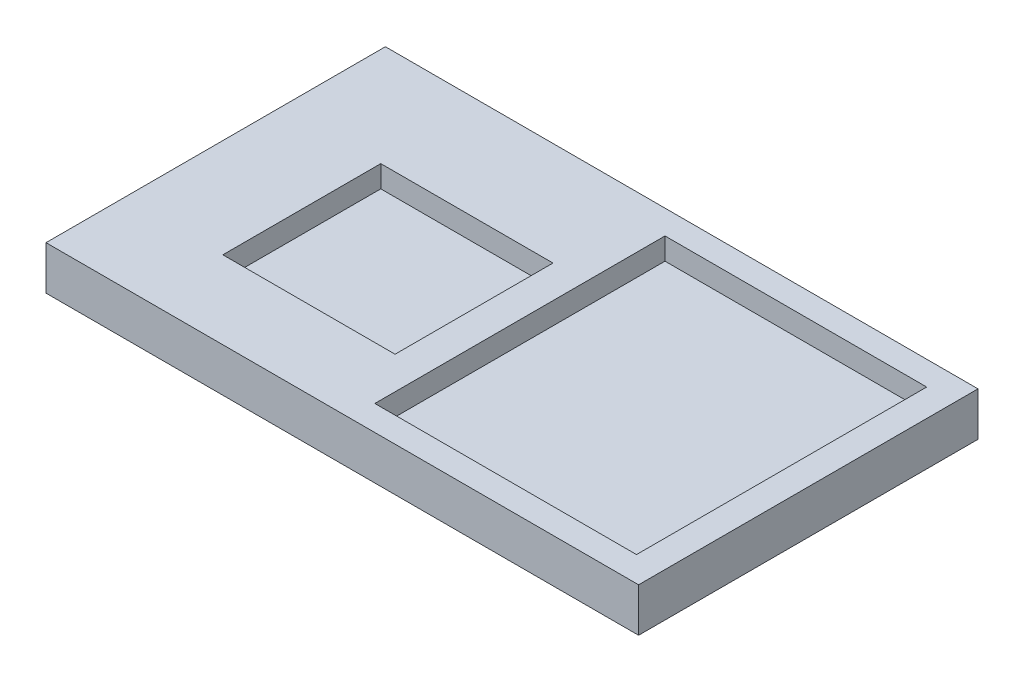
ISO-10303-21;
HEADER;
FILE_DESCRIPTION(('STEP AP214'),'2;1');
FILE_NAME('part.step','',(''),(''),'','','');
FILE_SCHEMA(('AUTOMOTIVE_DESIGN { 1 0 10303 214 1 1 1 1 }'));
ENDSEC;
DATA;
#1=APPLICATION_CONTEXT('core data for automotive mechanical design processes');
#2=APPLICATION_PROTOCOL_DEFINITION('international standard','automotive_design',2000,#1);
#3=PRODUCT_CONTEXT('',#1,'mechanical');
#4=PRODUCT('Part','Part','',(#3));
#5=PRODUCT_RELATED_PRODUCT_CATEGORY('part','',(#4));
#6=PRODUCT_DEFINITION_FORMATION('','',#4);
#7=PRODUCT_DEFINITION_CONTEXT('part definition',#1,'design');
#8=PRODUCT_DEFINITION('design','',#6,#7);
#9=PRODUCT_DEFINITION_SHAPE('','',#8);
#10=(LENGTH_UNIT() NAMED_UNIT(*) SI_UNIT(.MILLI.,.METRE.));
#11=(NAMED_UNIT(*) PLANE_ANGLE_UNIT() SI_UNIT($,.RADIAN.));
#12=(NAMED_UNIT(*) SI_UNIT($,.STERADIAN.) SOLID_ANGLE_UNIT());
#13=UNCERTAINTY_MEASURE_WITH_UNIT(LENGTH_MEASURE(1.E-05),#10,'distance_accuracy_value','');
#14=(GEOMETRIC_REPRESENTATION_CONTEXT(3) GLOBAL_UNCERTAINTY_ASSIGNED_CONTEXT((#13)) GLOBAL_UNIT_ASSIGNED_CONTEXT((#10,
#11,#12)) REPRESENTATION_CONTEXT('',''));
#15=CARTESIAN_POINT('',(0.,0.,0.));
#16=DIRECTION('',(0.,0.,1.));
#17=DIRECTION('',(1.,0.,0.));
#18=AXIS2_PLACEMENT_3D('',#15,#16,#17);
#19=CARTESIAN_POINT('',(-72.2568376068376,12.7,-49.1219729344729));
#20=DIRECTION('',(1.,0.,0.));
#21=DIRECTION('',(0.,0.,-1.));
#22=AXIS2_PLACEMENT_3D('',#19,#20,#21);
#23=PLANE('',#22);
#24=DIRECTION('',(0.,0.,1.));
#25=VECTOR('',#24,1.);
#26=CARTESIAN_POINT('',(-72.2568376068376,0.,-49.1219729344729));
#27=LINE('',#26,#25);
#28=CARTESIAN_POINT('',(-72.2568376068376,0.,-49.1219729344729));
#29=VERTEX_POINT('',#28);
#30=CARTESIAN_POINT('',(-72.2568376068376,0.,49.4388888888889));
#31=VERTEX_POINT('',#30);
#32=EDGE_CURVE('E191',#29,#31,#27,.T.);
#33=ORIENTED_EDGE('',*,*,#32,.T.);
#34=DIRECTION('',(0.,-1.,0.));
#35=VECTOR('',#34,1.);
#36=CARTESIAN_POINT('',(-72.2568376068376,12.7,49.4388888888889));
#37=LINE('',#36,#35);
#38=CARTESIAN_POINT('',(-72.2568376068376,12.7,49.4388888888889));
#39=VERTEX_POINT('',#38);
#40=EDGE_CURVE('E11',#39,#31,#37,.T.);
#41=ORIENTED_EDGE('',*,*,#40,.F.);
#42=DIRECTION('',(0.,0.,1.));
#43=VECTOR('',#42,1.);
#44=CARTESIAN_POINT('',(-72.2568376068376,12.7,-49.1219729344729));
#45=LINE('',#44,#43);
#46=CARTESIAN_POINT('',(-72.2568376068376,12.7,-49.1219729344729));
#47=VERTEX_POINT('',#46);
#48=EDGE_CURVE('E205',#47,#39,#45,.T.);
#49=ORIENTED_EDGE('',*,*,#48,.F.);
#50=DIRECTION('',(0.,-1.,0.));
#51=VECTOR('',#50,1.);
#52=CARTESIAN_POINT('',(-72.2568376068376,12.7,-49.1219729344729));
#53=LINE('',#52,#51);
#54=EDGE_CURVE('E214',#47,#29,#53,.T.);
#55=ORIENTED_EDGE('',*,*,#54,.T.);
#56=EDGE_LOOP('',(#33,#41,#49,#55));
#57=FACE_BOUND('',#56,.T.);
#58=ADVANCED_FACE('F38',(#57),#23,.F.);
#59=CARTESIAN_POINT('',(-72.2568376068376,12.7,49.4388888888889));
#60=DIRECTION('',(0.,0.,-1.));
#61=DIRECTION('',(-1.,0.,0.));
#62=AXIS2_PLACEMENT_3D('',#59,#60,#61);
#63=PLANE('',#62);
#64=DIRECTION('',(1.,0.,0.));
#65=VECTOR('',#64,1.);
#66=CARTESIAN_POINT('',(-72.2568376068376,0.,49.4388888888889));
#67=LINE('',#66,#65);
#68=CARTESIAN_POINT('',(99.8285256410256,0.,49.4388888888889));
#69=VERTEX_POINT('',#68);
#70=EDGE_CURVE('E199',#31,#69,#67,.T.);
#71=ORIENTED_EDGE('',*,*,#70,.T.);
#72=DIRECTION('',(0.,-1.,0.));
#73=VECTOR('',#72,1.);
#74=CARTESIAN_POINT('',(99.8285256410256,12.7,49.4388888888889));
#75=LINE('',#74,#73);
#76=CARTESIAN_POINT('',(99.8285256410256,12.7,49.4388888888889));
#77=VERTEX_POINT('',#76);
#78=EDGE_CURVE('E45',#77,#69,#75,.T.);
#79=ORIENTED_EDGE('',*,*,#78,.F.);
#80=DIRECTION('',(1.,0.,0.));
#81=VECTOR('',#80,1.);
#82=CARTESIAN_POINT('',(-72.2568376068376,12.7,49.4388888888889));
#83=LINE('',#82,#81);
#84=EDGE_CURVE('E208',#39,#77,#83,.T.);
#85=ORIENTED_EDGE('',*,*,#84,.F.);
#86=ORIENTED_EDGE('',*,*,#40,.T.);
#87=EDGE_LOOP('',(#71,#79,#85,#86));
#88=FACE_BOUND('',#87,.T.);
#89=ADVANCED_FACE('F239',(#88),#63,.F.);
#90=CARTESIAN_POINT('',(99.8285256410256,12.7,-49.1219729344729));
#91=DIRECTION('',(-1.,0.,0.));
#92=DIRECTION('',(0.,0.,1.));
#93=AXIS2_PLACEMENT_3D('',#90,#91,#92);
#94=PLANE('',#93);
#95=DIRECTION('',(0.,0.,-1.));
#96=VECTOR('',#95,1.);
#97=CARTESIAN_POINT('',(99.8285256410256,0.,-49.1219729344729));
#98=LINE('',#97,#96);
#99=CARTESIAN_POINT('',(99.8285256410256,0.,-49.1219729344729));
#100=VERTEX_POINT('',#99);
#101=EDGE_CURVE('E201',#69,#100,#98,.T.);
#102=ORIENTED_EDGE('',*,*,#101,.T.);
#103=DIRECTION('',(0.,-1.,0.));
#104=VECTOR('',#103,1.);
#105=CARTESIAN_POINT('',(99.8285256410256,12.7,-49.1219729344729));
#106=LINE('',#105,#104);
#107=CARTESIAN_POINT('',(99.8285256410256,12.7,-49.1219729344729));
#108=VERTEX_POINT('',#107);
#109=EDGE_CURVE('E217',#108,#100,#106,.T.);
#110=ORIENTED_EDGE('',*,*,#109,.F.);
#111=DIRECTION('',(0.,0.,-1.));
#112=VECTOR('',#111,1.);
#113=CARTESIAN_POINT('',(99.8285256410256,12.7,-49.1219729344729));
#114=LINE('',#113,#112);
#115=EDGE_CURVE('E210',#77,#108,#114,.T.);
#116=ORIENTED_EDGE('',*,*,#115,.F.);
#117=ORIENTED_EDGE('',*,*,#78,.T.);
#118=EDGE_LOOP('',(#102,#110,#116,#117));
#119=FACE_BOUND('',#118,.T.);
#120=ADVANCED_FACE('F224',(#119),#94,.F.);
#121=CARTESIAN_POINT('',(-72.2568376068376,12.7,-49.1219729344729));
#122=DIRECTION('',(0.,0.,1.));
#123=DIRECTION('',(1.,0.,0.));
#124=AXIS2_PLACEMENT_3D('',#121,#122,#123);
#125=PLANE('',#124);
#126=DIRECTION('',(-1.,0.,0.));
#127=VECTOR('',#126,1.);
#128=CARTESIAN_POINT('',(-72.2568376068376,0.,-49.1219729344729));
#129=LINE('',#128,#127);
#130=EDGE_CURVE('E203',#100,#29,#129,.T.);
#131=ORIENTED_EDGE('',*,*,#130,.T.);
#132=ORIENTED_EDGE('',*,*,#54,.F.);
#133=DIRECTION('',(-1.,0.,0.));
#134=VECTOR('',#133,1.);
#135=CARTESIAN_POINT('',(-72.2568376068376,12.7,-49.1219729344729));
#136=LINE('',#135,#134);
#137=EDGE_CURVE('E212',#108,#47,#136,.T.);
#138=ORIENTED_EDGE('',*,*,#137,.F.);
#139=ORIENTED_EDGE('',*,*,#109,.T.);
#140=EDGE_LOOP('',(#131,#132,#138,#139));
#141=FACE_BOUND('',#140,.T.);
#142=ADVANCED_FACE('F233',(#141),#125,.F.);
#143=CARTESIAN_POINT('',(-72.2568376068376,12.7,49.4388888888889));
#144=DIRECTION('',(0.,1.,0.));
#145=DIRECTION('',(0.,0.,1.));
#146=AXIS2_PLACEMENT_3D('',#143,#144,#145);
#147=PLANE('',#146);
#148=DIRECTION('',(0.,0.,-1.));
#149=VECTOR('',#148,1.);
#150=CARTESIAN_POINT('',(91.9228946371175,12.7,-42.1274752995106));
#151=LINE('',#150,#149);
#152=CARTESIAN_POINT('',(91.9228946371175,12.7,42.1379714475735));
#153=VERTEX_POINT('',#152);
#154=CARTESIAN_POINT('',(91.9228946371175,12.7,-42.1274752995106));
#155=VERTEX_POINT('',#154);
#156=EDGE_CURVE('E52',#153,#155,#151,.T.);
#157=ORIENTED_EDGE('',*,*,#156,.F.);
#158=DIRECTION('',(1.,0.,0.));
#159=VECTOR('',#158,1.);
#160=CARTESIAN_POINT('',(91.9228946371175,12.7,42.1379714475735));
#161=LINE('',#160,#159);
#162=CARTESIAN_POINT('',(15.9307826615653,12.7,42.1379714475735));
#163=VERTEX_POINT('',#162);
#164=EDGE_CURVE('E148',#163,#153,#161,.T.);
#165=ORIENTED_EDGE('',*,*,#164,.F.);
#166=DIRECTION('',(0.,0.,1.));
#167=VECTOR('',#166,1.);
#168=CARTESIAN_POINT('',(15.9307826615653,12.7,-42.1274752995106));
#169=LINE('',#168,#167);
#170=CARTESIAN_POINT('',(15.9307826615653,12.7,-42.1274752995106));
#171=VERTEX_POINT('',#170);
#172=EDGE_CURVE('E130',#171,#163,#169,.T.);
#173=ORIENTED_EDGE('',*,*,#172,.F.);
#174=DIRECTION('',(-1.,0.,0.));
#175=VECTOR('',#174,1.);
#176=CARTESIAN_POINT('',(91.9228946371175,12.7,-42.1274752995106));
#177=LINE('',#176,#175);
#178=EDGE_CURVE('E141',#155,#171,#177,.T.);
#179=ORIENTED_EDGE('',*,*,#178,.F.);
#180=EDGE_LOOP('',(#157,#165,#173,#179));
#181=FACE_BOUND('',#180,.T.);
#182=DIRECTION('',(0.,0.,1.));
#183=VECTOR('',#182,1.);
#184=CARTESIAN_POINT('',(-43.5257767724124,12.7,-19.049033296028));
#185=LINE('',#184,#183);
#186=CARTESIAN_POINT('',(-43.5257767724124,12.7,-19.049033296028));
#187=VERTEX_POINT('',#186);
#188=CARTESIAN_POINT('',(-43.5257767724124,12.7,26.8129621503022));
#189=VERTEX_POINT('',#188);
#190=EDGE_CURVE('E60',#187,#189,#185,.T.);
#191=ORIENTED_EDGE('',*,*,#190,.F.);
#192=DIRECTION('',(-1.,0.,0.));
#193=VECTOR('',#192,1.);
#194=CARTESIAN_POINT('',(-43.5257767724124,12.7,-19.049033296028));
#195=LINE('',#194,#193);
#196=CARTESIAN_POINT('',(6.48273151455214,12.7,-19.049033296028));
#197=VERTEX_POINT('',#196);
#198=EDGE_CURVE('E173',#197,#187,#195,.T.);
#199=ORIENTED_EDGE('',*,*,#198,.F.);
#200=DIRECTION('',(0.,0.,-1.));
#201=VECTOR('',#200,1.);
#202=CARTESIAN_POINT('',(6.48273151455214,12.7,-19.049033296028));
#203=LINE('',#202,#201);
#204=CARTESIAN_POINT('',(6.48273151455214,12.7,26.8129621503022));
#205=VERTEX_POINT('',#204);
#206=EDGE_CURVE('E170',#205,#197,#203,.T.);
#207=ORIENTED_EDGE('',*,*,#206,.F.);
#208=DIRECTION('',(1.,0.,0.));
#209=VECTOR('',#208,1.);
#210=CARTESIAN_POINT('',(-43.5257767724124,12.7,26.8129621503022));
#211=LINE('',#210,#209);
#212=EDGE_CURVE('E167',#189,#205,#211,.T.);
#213=ORIENTED_EDGE('',*,*,#212,.F.);
#214=EDGE_LOOP('',(#191,#199,#207,#213));
#215=FACE_BOUND('',#214,.T.);
#216=ORIENTED_EDGE('',*,*,#48,.T.);
#217=ORIENTED_EDGE('',*,*,#84,.T.);
#218=ORIENTED_EDGE('',*,*,#115,.T.);
#219=ORIENTED_EDGE('',*,*,#137,.T.);
#220=EDGE_LOOP('',(#216,#217,#218,#219));
#221=FACE_BOUND('',#220,.T.);
#222=ADVANCED_FACE('F145',(#181,#215,#221),#147,.T.);
#223=CARTESIAN_POINT('',(-72.2568376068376,0.,49.4388888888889));
#224=DIRECTION('',(0.,1.,0.));
#225=DIRECTION('',(0.,0.,1.));
#226=AXIS2_PLACEMENT_3D('',#223,#224,#225);
#227=PLANE('',#226);
#228=ORIENTED_EDGE('',*,*,#32,.F.);
#229=ORIENTED_EDGE('',*,*,#130,.F.);
#230=ORIENTED_EDGE('',*,*,#101,.F.);
#231=ORIENTED_EDGE('',*,*,#70,.F.);
#232=EDGE_LOOP('',(#228,#229,#230,#231));
#233=FACE_BOUND('',#232,.T.);
#234=ADVANCED_FACE('F230',(#233),#227,.F.);
#235=CARTESIAN_POINT('',(-43.5257767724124,6.35,-19.049033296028));
#236=DIRECTION('',(-1.,0.,0.));
#237=DIRECTION('',(0.,0.,1.));
#238=AXIS2_PLACEMENT_3D('',#235,#236,#237);
#239=PLANE('',#238);
#240=ORIENTED_EDGE('',*,*,#190,.T.);
#241=DIRECTION('',(0.,1.,0.));
#242=VECTOR('',#241,1.);
#243=CARTESIAN_POINT('',(-43.5257767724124,6.35,26.8129621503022));
#244=LINE('',#243,#242);
#245=CARTESIAN_POINT('',(-43.5257767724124,6.35,26.8129621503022));
#246=VERTEX_POINT('',#245);
#247=EDGE_CURVE('E188',#246,#189,#244,.T.);
#248=ORIENTED_EDGE('',*,*,#247,.F.);
#249=DIRECTION('',(0.,0.,1.));
#250=VECTOR('',#249,1.);
#251=CARTESIAN_POINT('',(-43.5257767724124,6.35,-19.049033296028));
#252=LINE('',#251,#250);
#253=CARTESIAN_POINT('',(-43.5257767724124,6.35,-19.049033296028));
#254=VERTEX_POINT('',#253);
#255=EDGE_CURVE('E176',#254,#246,#252,.T.);
#256=ORIENTED_EDGE('',*,*,#255,.F.);
#257=DIRECTION('',(0.,1.,0.));
#258=VECTOR('',#257,1.);
#259=CARTESIAN_POINT('',(-43.5257767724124,6.35,-19.049033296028));
#260=LINE('',#259,#258);
#261=EDGE_CURVE('E189',#254,#187,#260,.T.);
#262=ORIENTED_EDGE('',*,*,#261,.T.);
#263=EDGE_LOOP('',(#240,#248,#256,#262));
#264=FACE_BOUND('',#263,.T.);
#265=ADVANCED_FACE('F253',(#264),#239,.F.);
#266=CARTESIAN_POINT('',(-43.5257767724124,6.35,-19.049033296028));
#267=DIRECTION('',(0.,0.,-1.));
#268=DIRECTION('',(-1.,0.,0.));
#269=AXIS2_PLACEMENT_3D('',#266,#267,#268);
#270=PLANE('',#269);
#271=ORIENTED_EDGE('',*,*,#198,.T.);
#272=ORIENTED_EDGE('',*,*,#261,.F.);
#273=DIRECTION('',(-1.,0.,0.));
#274=VECTOR('',#273,1.);
#275=CARTESIAN_POINT('',(-43.5257767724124,6.35,-19.049033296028));
#276=LINE('',#275,#274);
#277=CARTESIAN_POINT('',(6.48273151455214,6.35,-19.049033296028));
#278=VERTEX_POINT('',#277);
#279=EDGE_CURVE('E185',#278,#254,#276,.T.);
#280=ORIENTED_EDGE('',*,*,#279,.F.);
#281=DIRECTION('',(0.,1.,0.));
#282=VECTOR('',#281,1.);
#283=CARTESIAN_POINT('',(6.48273151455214,6.35,-19.049033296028));
#284=LINE('',#283,#282);
#285=EDGE_CURVE('E192',#278,#197,#284,.T.);
#286=ORIENTED_EDGE('',*,*,#285,.T.);
#287=EDGE_LOOP('',(#271,#272,#280,#286));
#288=FACE_BOUND('',#287,.T.);
#289=ADVANCED_FACE('F256',(#288),#270,.F.);
#290=CARTESIAN_POINT('',(6.48273151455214,6.35,-19.049033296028));
#291=DIRECTION('',(1.,0.,0.));
#292=DIRECTION('',(0.,0.,-1.));
#293=AXIS2_PLACEMENT_3D('',#290,#291,#292);
#294=PLANE('',#293);
#295=ORIENTED_EDGE('',*,*,#206,.T.);
#296=ORIENTED_EDGE('',*,*,#285,.F.);
#297=DIRECTION('',(0.,0.,-1.));
#298=VECTOR('',#297,1.);
#299=CARTESIAN_POINT('',(6.48273151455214,6.35,-19.049033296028));
#300=LINE('',#299,#298);
#301=CARTESIAN_POINT('',(6.48273151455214,6.35,26.8129621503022));
#302=VERTEX_POINT('',#301);
#303=EDGE_CURVE('E182',#302,#278,#300,.T.);
#304=ORIENTED_EDGE('',*,*,#303,.F.);
#305=DIRECTION('',(0.,1.,0.));
#306=VECTOR('',#305,1.);
#307=CARTESIAN_POINT('',(6.48273151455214,6.35,26.8129621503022));
#308=LINE('',#307,#306);
#309=EDGE_CURVE('E194',#302,#205,#308,.T.);
#310=ORIENTED_EDGE('',*,*,#309,.T.);
#311=EDGE_LOOP('',(#295,#296,#304,#310));
#312=FACE_BOUND('',#311,.T.);
#313=ADVANCED_FACE('F261',(#312),#294,.F.);
#314=CARTESIAN_POINT('',(-43.5257767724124,6.35,26.8129621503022));
#315=DIRECTION('',(0.,0.,1.));
#316=DIRECTION('',(1.,0.,0.));
#317=AXIS2_PLACEMENT_3D('',#314,#315,#316);
#318=PLANE('',#317);
#319=ORIENTED_EDGE('',*,*,#212,.T.);
#320=ORIENTED_EDGE('',*,*,#309,.F.);
#321=DIRECTION('',(1.,0.,0.));
#322=VECTOR('',#321,1.);
#323=CARTESIAN_POINT('',(-43.5257767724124,6.35,26.8129621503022));
#324=LINE('',#323,#322);
#325=EDGE_CURVE('E179',#246,#302,#324,.T.);
#326=ORIENTED_EDGE('',*,*,#325,.F.);
#327=ORIENTED_EDGE('',*,*,#247,.T.);
#328=EDGE_LOOP('',(#319,#320,#326,#327));
#329=FACE_BOUND('',#328,.T.);
#330=ADVANCED_FACE('F257',(#329),#318,.F.);
#331=CARTESIAN_POINT('',(-43.5257767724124,6.35,26.8129621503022));
#332=DIRECTION('',(0.,1.,0.));
#333=DIRECTION('',(0.,0.,1.));
#334=AXIS2_PLACEMENT_3D('',#331,#332,#333);
#335=PLANE('',#334);
#336=ORIENTED_EDGE('',*,*,#255,.T.);
#337=ORIENTED_EDGE('',*,*,#325,.T.);
#338=ORIENTED_EDGE('',*,*,#303,.T.);
#339=ORIENTED_EDGE('',*,*,#279,.T.);
#340=EDGE_LOOP('',(#336,#337,#338,#339));
#341=FACE_BOUND('',#340,.T.);
#342=ADVANCED_FACE('F260',(#341),#335,.T.);
#343=CARTESIAN_POINT('',(91.9228946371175,6.35,-42.1274752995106));
#344=DIRECTION('',(1.,0.,0.));
#345=DIRECTION('',(0.,0.,-1.));
#346=AXIS2_PLACEMENT_3D('',#343,#344,#345);
#347=PLANE('',#346);
#348=ORIENTED_EDGE('',*,*,#156,.T.);
#349=DIRECTION('',(0.,1.,0.));
#350=VECTOR('',#349,1.);
#351=CARTESIAN_POINT('',(91.9228946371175,6.35,-42.1274752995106));
#352=LINE('',#351,#350);
#353=CARTESIAN_POINT('',(91.9228946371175,6.35,-42.1274752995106));
#354=VERTEX_POINT('',#353);
#355=EDGE_CURVE('E138',#354,#155,#352,.T.);
#356=ORIENTED_EDGE('',*,*,#355,.F.);
#357=DIRECTION('',(0.,0.,-1.));
#358=VECTOR('',#357,1.);
#359=CARTESIAN_POINT('',(91.9228946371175,6.35,-42.1274752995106));
#360=LINE('',#359,#358);
#361=CARTESIAN_POINT('',(91.9228946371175,6.35,42.1379714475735));
#362=VERTEX_POINT('',#361);
#363=EDGE_CURVE('E150',#362,#354,#360,.T.);
#364=ORIENTED_EDGE('',*,*,#363,.F.);
#365=DIRECTION('',(0.,1.,0.));
#366=VECTOR('',#365,1.);
#367=CARTESIAN_POINT('',(91.9228946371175,6.35,42.1379714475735));
#368=LINE('',#367,#366);
#369=EDGE_CURVE('E162',#362,#153,#368,.T.);
#370=ORIENTED_EDGE('',*,*,#369,.T.);
#371=EDGE_LOOP('',(#348,#356,#364,#370));
#372=FACE_BOUND('',#371,.T.);
#373=ADVANCED_FACE('F271',(#372),#347,.F.);
#374=CARTESIAN_POINT('',(91.9228946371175,6.35,42.1379714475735));
#375=DIRECTION('',(0.,0.,1.));
#376=DIRECTION('',(1.,0.,0.));
#377=AXIS2_PLACEMENT_3D('',#374,#375,#376);
#378=PLANE('',#377);
#379=ORIENTED_EDGE('',*,*,#164,.T.);
#380=ORIENTED_EDGE('',*,*,#369,.F.);
#381=DIRECTION('',(1.,0.,0.));
#382=VECTOR('',#381,1.);
#383=CARTESIAN_POINT('',(91.9228946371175,6.35,42.1379714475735));
#384=LINE('',#383,#382);
#385=CARTESIAN_POINT('',(15.9307826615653,6.35,42.1379714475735));
#386=VERTEX_POINT('',#385);
#387=EDGE_CURVE('E159',#386,#362,#384,.T.);
#388=ORIENTED_EDGE('',*,*,#387,.F.);
#389=DIRECTION('',(0.,1.,0.));
#390=VECTOR('',#389,1.);
#391=CARTESIAN_POINT('',(15.9307826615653,6.35,42.1379714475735));
#392=LINE('',#391,#390);
#393=EDGE_CURVE('E137',#386,#163,#392,.T.);
#394=ORIENTED_EDGE('',*,*,#393,.T.);
#395=EDGE_LOOP('',(#379,#380,#388,#394));
#396=FACE_BOUND('',#395,.T.);
#397=ADVANCED_FACE('F275',(#396),#378,.F.);
#398=CARTESIAN_POINT('',(15.9307826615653,6.35,-42.1274752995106));
#399=DIRECTION('',(-1.,0.,0.));
#400=DIRECTION('',(0.,0.,1.));
#401=AXIS2_PLACEMENT_3D('',#398,#399,#400);
#402=PLANE('',#401);
#403=ORIENTED_EDGE('',*,*,#172,.T.);
#404=ORIENTED_EDGE('',*,*,#393,.F.);
#405=DIRECTION('',(0.,0.,1.));
#406=VECTOR('',#405,1.);
#407=CARTESIAN_POINT('',(15.9307826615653,6.35,-42.1274752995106));
#408=LINE('',#407,#406);
#409=CARTESIAN_POINT('',(15.9307826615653,6.35,-42.1274752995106));
#410=VERTEX_POINT('',#409);
#411=EDGE_CURVE('E133',#410,#386,#408,.T.);
#412=ORIENTED_EDGE('',*,*,#411,.F.);
#413=DIRECTION('',(0.,1.,0.));
#414=VECTOR('',#413,1.);
#415=CARTESIAN_POINT('',(15.9307826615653,6.35,-42.1274752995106));
#416=LINE('',#415,#414);
#417=EDGE_CURVE('E126',#410,#171,#416,.T.);
#418=ORIENTED_EDGE('',*,*,#417,.T.);
#419=EDGE_LOOP('',(#403,#404,#412,#418));
#420=FACE_BOUND('',#419,.T.);
#421=ADVANCED_FACE('F128',(#420),#402,.F.);
#422=CARTESIAN_POINT('',(91.9228946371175,6.35,-42.1274752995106));
#423=DIRECTION('',(0.,0.,-1.));
#424=DIRECTION('',(-1.,0.,0.));
#425=AXIS2_PLACEMENT_3D('',#422,#423,#424);
#426=PLANE('',#425);
#427=ORIENTED_EDGE('',*,*,#178,.T.);
#428=ORIENTED_EDGE('',*,*,#417,.F.);
#429=DIRECTION('',(-1.,0.,0.));
#430=VECTOR('',#429,1.);
#431=CARTESIAN_POINT('',(91.9228946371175,6.35,-42.1274752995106));
#432=LINE('',#431,#430);
#433=EDGE_CURVE('E156',#354,#410,#432,.T.);
#434=ORIENTED_EDGE('',*,*,#433,.F.);
#435=ORIENTED_EDGE('',*,*,#355,.T.);
#436=EDGE_LOOP('',(#427,#428,#434,#435));
#437=FACE_BOUND('',#436,.T.);
#438=ADVANCED_FACE('F142',(#437),#426,.F.);
#439=CARTESIAN_POINT('',(91.9228946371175,6.35,42.1379714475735));
#440=DIRECTION('',(0.,-1.,0.));
#441=DIRECTION('',(0.,0.,-1.));
#442=AXIS2_PLACEMENT_3D('',#439,#440,#441);
#443=PLANE('',#442);
#444=ORIENTED_EDGE('',*,*,#363,.T.);
#445=ORIENTED_EDGE('',*,*,#433,.T.);
#446=ORIENTED_EDGE('',*,*,#411,.T.);
#447=ORIENTED_EDGE('',*,*,#387,.T.);
#448=EDGE_LOOP('',(#444,#445,#446,#447));
#449=FACE_BOUND('',#448,.T.);
#450=ADVANCED_FACE('F278',(#449),#443,.F.);
#451=CLOSED_SHELL('',(#58,#89,#120,#142,#222,#234,#265,#289,#313,#330,#342,#373,#397,#421,#438,#450));
#452=MANIFOLD_SOLID_BREP('B2',#451);
#453=ADVANCED_BREP_SHAPE_REPRESENTATION('',(#18,#452),#14);
#454=SHAPE_DEFINITION_REPRESENTATION(#9,#453);
ENDSEC;
END-ISO-10303-21;
